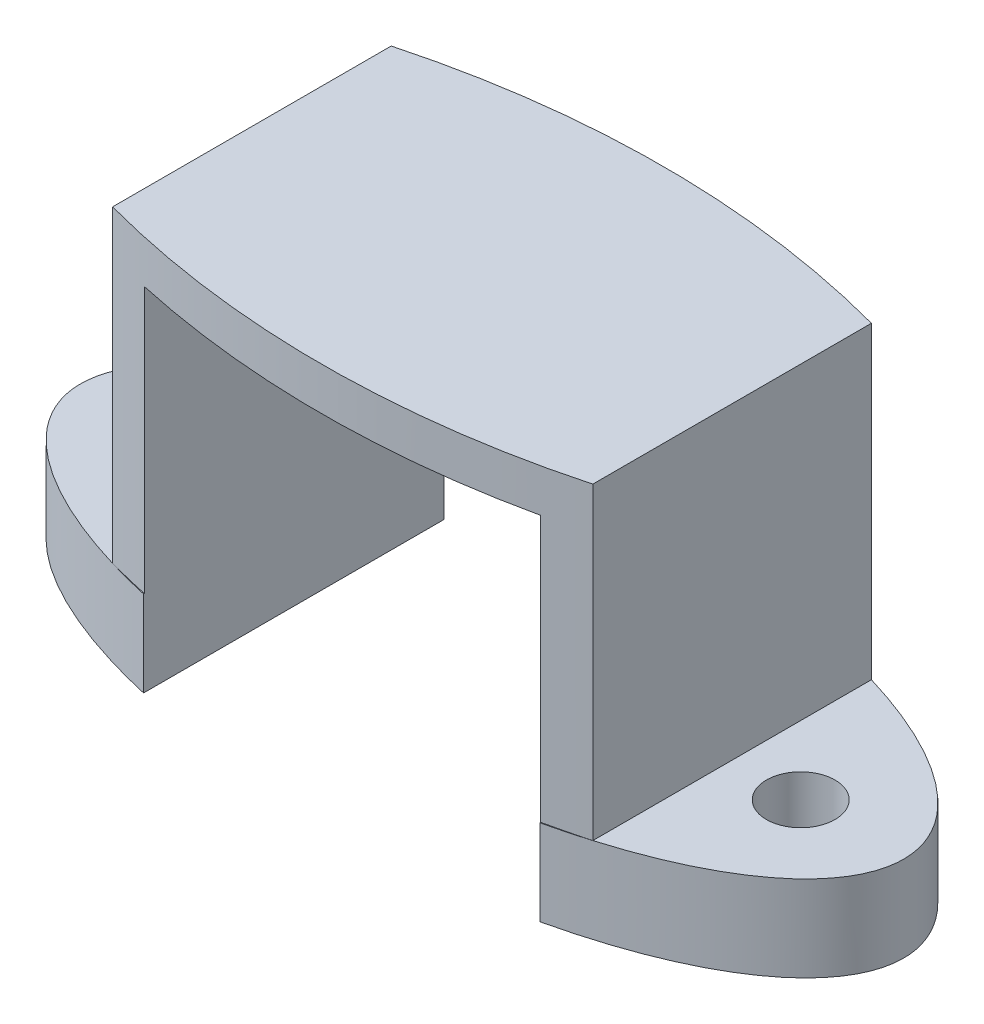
ISO-10303-21;
HEADER;
FILE_DESCRIPTION(('STEP AP214'),'2;1');
FILE_NAME('part.step','',(''),(''),'','','');
FILE_SCHEMA(('AUTOMOTIVE_DESIGN { 1 0 10303 214 1 1 1 1 }'));
ENDSEC;
DATA;
#1=APPLICATION_CONTEXT('core data for automotive mechanical design processes');
#2=APPLICATION_PROTOCOL_DEFINITION('international standard','automotive_design',2000,#1);
#3=PRODUCT_CONTEXT('',#1,'mechanical');
#4=PRODUCT('Part','Part','',(#3));
#5=PRODUCT_RELATED_PRODUCT_CATEGORY('part','',(#4));
#6=PRODUCT_DEFINITION_FORMATION('','',#4);
#7=PRODUCT_DEFINITION_CONTEXT('part definition',#1,'design');
#8=PRODUCT_DEFINITION('design','',#6,#7);
#9=PRODUCT_DEFINITION_SHAPE('','',#8);
#10=(LENGTH_UNIT() NAMED_UNIT(*) SI_UNIT(.MILLI.,.METRE.));
#11=(NAMED_UNIT(*) PLANE_ANGLE_UNIT() SI_UNIT($,.RADIAN.));
#12=(NAMED_UNIT(*) SI_UNIT($,.STERADIAN.) SOLID_ANGLE_UNIT());
#13=UNCERTAINTY_MEASURE_WITH_UNIT(LENGTH_MEASURE(1.E-05),#10,'distance_accuracy_value','');
#14=(GEOMETRIC_REPRESENTATION_CONTEXT(3) GLOBAL_UNCERTAINTY_ASSIGNED_CONTEXT((#13)) GLOBAL_UNIT_ASSIGNED_CONTEXT((#10,
#11,#12)) REPRESENTATION_CONTEXT('',''));
#15=CARTESIAN_POINT('',(0.,0.,0.));
#16=DIRECTION('',(0.,0.,1.));
#17=DIRECTION('',(1.,0.,0.));
#18=AXIS2_PLACEMENT_3D('',#15,#16,#17);
#19=CARTESIAN_POINT('',(0.,2.5,0.));
#20=DIRECTION('',(0.,1.,0.));
#21=DIRECTION('',(0.,0.,1.));
#22=AXIS2_PLACEMENT_3D('',#19,#20,#21);
#23=PLANE('',#22);
#24=DIRECTION('',(0.,0.,-1.));
#25=VECTOR('',#24,1.);
#26=CARTESIAN_POINT('',(5.775,2.5,0.));
#27=LINE('',#26,#25);
#28=CARTESIAN_POINT('',(5.775,2.5,-4.36066307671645));
#29=VERTEX_POINT('',#28);
#30=CARTESIAN_POINT('',(5.775,2.5,-4.3829169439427));
#31=VERTEX_POINT('',#30);
#32=EDGE_CURVE('E158',#29,#31,#27,.T.);
#33=ORIENTED_EDGE('',*,*,#32,.F.);
#34=CARTESIAN_POINT('',(0.,2.5,21.9150286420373));
#35=DIRECTION('',(0.,1.,0.));
#36=DIRECTION('',(0.,0.,-1.));
#37=AXIS2_PLACEMENT_3D('',#34,#35,#36);
#38=CIRCLE('',#37,26.9028362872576);
#39=CARTESIAN_POINT('',(6.99999999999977,2.5,-4.06116431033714));
#40=VERTEX_POINT('',#39);
#41=EDGE_CURVE('E155',#40,#29,#38,.T.);
#42=ORIENTED_EDGE('',*,*,#41,.F.);
#43=CARTESIAN_POINT('',(0.,2.5,0.));
#44=DIRECTION('',(0.,1.,0.));
#45=DIRECTION('',(1.,0.,0.));
#46=AXIS2_PLACEMENT_3D('',#43,#44,#45);
#47=ELLIPSE('',#46,12.,5.);
#48=EDGE_CURVE('E205',#40,#31,#47,.T.);
#49=ORIENTED_EDGE('',*,*,#48,.T.);
#50=EDGE_LOOP('',(#33,#42,#49));
#51=FACE_BOUND('',#50,.T.);
#52=ADVANCED_FACE('F39',(#51),#23,.T.);
#53=DIRECTION('',(0.,0.,-1.));
#54=VECTOR('',#53,1.);
#55=CARTESIAN_POINT('',(5.775,2.5,0.));
#56=LINE('',#55,#54);
#57=CARTESIAN_POINT('',(5.775,2.5,4.3829169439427));
#58=VERTEX_POINT('',#57);
#59=CARTESIAN_POINT('',(5.775,2.5,4.36066097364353));
#60=VERTEX_POINT('',#59);
#61=EDGE_CURVE('E237',#58,#60,#56,.T.);
#62=ORIENTED_EDGE('',*,*,#61,.F.);
#63=CARTESIAN_POINT('',(6.99999999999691,2.5,4.06116431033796));
#64=VERTEX_POINT('',#63);
#65=EDGE_CURVE('E63',#58,#64,#47,.T.);
#66=ORIENTED_EDGE('',*,*,#65,.T.);
#67=CARTESIAN_POINT('',(0.,2.5,-21.9152131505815));
#68=DIRECTION('',(0.,1.,0.));
#69=DIRECTION('',(0.,0.,1.));
#70=AXIS2_PLACEMENT_3D('',#67,#68,#69);
#71=CIRCLE('',#70,26.9030144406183);
#72=EDGE_CURVE('E176',#60,#64,#71,.T.);
#73=ORIENTED_EDGE('',*,*,#72,.F.);
#74=EDGE_LOOP('',(#62,#66,#73));
#75=FACE_BOUND('',#74,.T.);
#76=ADVANCED_FACE('F282',(#75),#23,.T.);
#77=DIRECTION('',(0.,-1.,0.));
#78=VECTOR('',#77,1.);
#79=SURFACE_OF_LINEAR_EXTRUSION('',#47,#78);
#80=CARTESIAN_POINT('',(0.,0.,0.));
#81=DIRECTION('',(0.,1.,0.));
#82=DIRECTION('',(1.,0.,0.));
#83=AXIS2_PLACEMENT_3D('',#80,#81,#82);
#84=ELLIPSE('',#83,12.,5.);
#85=CARTESIAN_POINT('',(5.775,0.,4.3829169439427));
#86=VERTEX_POINT('',#85);
#87=CARTESIAN_POINT('',(5.775,0.,-4.3829169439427));
#88=VERTEX_POINT('',#87);
#89=EDGE_CURVE('E197',#86,#88,#84,.T.);
#90=ORIENTED_EDGE('',*,*,#89,.T.);
#91=DIRECTION('',(0.,-1.,0.));
#92=VECTOR('',#91,1.);
#93=CARTESIAN_POINT('',(5.775,2.5,-4.3829169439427));
#94=LINE('',#93,#92);
#95=EDGE_CURVE('E153',#88,#31,#94,.F.);
#96=ORIENTED_EDGE('',*,*,#95,.T.);
#97=ORIENTED_EDGE('',*,*,#48,.F.);
#98=EDGE_CURVE('E255',#64,#40,#47,.T.);
#99=ORIENTED_EDGE('',*,*,#98,.F.);
#100=ORIENTED_EDGE('',*,*,#65,.F.);
#101=DIRECTION('',(0.,-1.,0.));
#102=VECTOR('',#101,1.);
#103=CARTESIAN_POINT('',(5.775,2.5,4.3829169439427));
#104=LINE('',#103,#102);
#105=EDGE_CURVE('E239',#58,#86,#104,.T.);
#106=ORIENTED_EDGE('',*,*,#105,.T.);
#107=EDGE_LOOP('',(#90,#96,#97,#99,#100,#106));
#108=FACE_BOUND('',#107,.T.);
#109=ADVANCED_FACE('F249',(#108),#79,.F.);
#110=CARTESIAN_POINT('',(0.,0.,0.));
#111=DIRECTION('',(0.,1.,0.));
#112=DIRECTION('',(0.,0.,1.));
#113=AXIS2_PLACEMENT_3D('',#110,#111,#112);
#114=PLANE('',#113);
#115=CARTESIAN_POINT('',(9.,0.,0.));
#116=DIRECTION('',(0.,1.,0.));
#117=DIRECTION('',(0.,0.,1.));
#118=AXIS2_PLACEMENT_3D('',#115,#116,#117);
#119=CIRCLE('',#118,1.);
#120=CARTESIAN_POINT('',(9.,0.,1.));
#121=VERTEX_POINT('',#120);
#122=EDGE_CURVE('E194',#121,#121,#119,.T.);
#123=ORIENTED_EDGE('',*,*,#122,.T.);
#124=EDGE_LOOP('',(#123));
#125=FACE_BOUND('',#124,.T.);
#126=ORIENTED_EDGE('',*,*,#89,.F.);
#127=DIRECTION('',(0.,0.,1.));
#128=VECTOR('',#127,1.);
#129=CARTESIAN_POINT('',(5.775,0.,-10.));
#130=LINE('',#129,#128);
#131=EDGE_CURVE('E229',#88,#86,#130,.T.);
#132=ORIENTED_EDGE('',*,*,#131,.F.);
#133=EDGE_LOOP('',(#126,#132));
#134=FACE_BOUND('',#133,.T.);
#135=ADVANCED_FACE('F273',(#125,#134),#114,.F.);
#136=DIRECTION('',(0.,0.,1.));
#137=VECTOR('',#136,1.);
#138=CARTESIAN_POINT('',(-5.775,2.5,0.));
#139=LINE('',#138,#137);
#140=CARTESIAN_POINT('',(-5.775,2.5,-4.3829169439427));
#141=VERTEX_POINT('',#140);
#142=CARTESIAN_POINT('',(-5.775,2.5,-4.36066307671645));
#143=VERTEX_POINT('',#142);
#144=EDGE_CURVE('E132',#141,#143,#139,.T.);
#145=ORIENTED_EDGE('',*,*,#144,.F.);
#146=CARTESIAN_POINT('',(-6.99999999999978,2.5,-4.06116431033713));
#147=VERTEX_POINT('',#146);
#148=EDGE_CURVE('E210',#141,#147,#47,.T.);
#149=ORIENTED_EDGE('',*,*,#148,.T.);
#150=EDGE_CURVE('E152',#143,#147,#38,.T.);
#151=ORIENTED_EDGE('',*,*,#150,.F.);
#152=EDGE_LOOP('',(#145,#149,#151));
#153=FACE_BOUND('',#152,.T.);
#154=ADVANCED_FACE('F275',(#153),#23,.T.);
#155=DIRECTION('',(0.,0.,-1.));
#156=VECTOR('',#155,1.);
#157=CARTESIAN_POINT('',(6.99999999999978,2.5,4.06116431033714));
#158=LINE('',#157,#156);
#159=EDGE_CURVE('E166',#64,#40,#158,.T.);
#160=ORIENTED_EDGE('',*,*,#159,.F.);
#161=ORIENTED_EDGE('',*,*,#98,.T.);
#162=EDGE_LOOP('',(#160,#161));
#163=FACE_BOUND('',#162,.T.);
#164=CARTESIAN_POINT('',(9.,2.5,0.));
#165=DIRECTION('',(0.,1.,0.));
#166=DIRECTION('',(0.,0.,1.));
#167=AXIS2_PLACEMENT_3D('',#164,#165,#166);
#168=CIRCLE('',#167,1.);
#169=CARTESIAN_POINT('',(9.,2.5,1.));
#170=VERTEX_POINT('',#169);
#171=EDGE_CURVE('E198',#170,#170,#168,.T.);
#172=ORIENTED_EDGE('',*,*,#171,.F.);
#173=EDGE_LOOP('',(#172));
#174=FACE_BOUND('',#173,.T.);
#175=ADVANCED_FACE('F256',(#163,#174),#23,.T.);
#176=DIRECTION('',(0.,0.,1.));
#177=VECTOR('',#176,1.);
#178=CARTESIAN_POINT('',(-5.775,2.5,0.));
#179=LINE('',#178,#177);
#180=CARTESIAN_POINT('',(-5.775,2.5,4.36066097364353));
#181=VERTEX_POINT('',#180);
#182=CARTESIAN_POINT('',(-5.775,2.5,4.3829169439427));
#183=VERTEX_POINT('',#182);
#184=EDGE_CURVE('E219',#181,#183,#179,.T.);
#185=ORIENTED_EDGE('',*,*,#184,.F.);
#186=CARTESIAN_POINT('',(-6.99999999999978,2.5,4.06116431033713));
#187=VERTEX_POINT('',#186);
#188=EDGE_CURVE('E177',#187,#181,#71,.T.);
#189=ORIENTED_EDGE('',*,*,#188,.F.);
#190=EDGE_CURVE('E225',#187,#183,#47,.T.);
#191=ORIENTED_EDGE('',*,*,#190,.T.);
#192=EDGE_LOOP('',(#185,#189,#191));
#193=FACE_BOUND('',#192,.T.);
#194=ADVANCED_FACE('F223',(#193),#23,.T.);
#195=CARTESIAN_POINT('',(-5.775,0.,-4.3829169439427));
#196=VERTEX_POINT('',#195);
#197=CARTESIAN_POINT('',(-5.775,0.,4.3829169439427));
#198=VERTEX_POINT('',#197);
#199=EDGE_CURVE('E214',#196,#198,#84,.T.);
#200=ORIENTED_EDGE('',*,*,#199,.T.);
#201=DIRECTION('',(0.,-1.,0.));
#202=VECTOR('',#201,1.);
#203=CARTESIAN_POINT('',(-5.775,2.5,4.3829169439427));
#204=LINE('',#203,#202);
#205=EDGE_CURVE('E137',#198,#183,#204,.F.);
#206=ORIENTED_EDGE('',*,*,#205,.T.);
#207=ORIENTED_EDGE('',*,*,#190,.F.);
#208=EDGE_CURVE('E211',#147,#187,#47,.T.);
#209=ORIENTED_EDGE('',*,*,#208,.F.);
#210=ORIENTED_EDGE('',*,*,#148,.F.);
#211=DIRECTION('',(0.,-1.,0.));
#212=VECTOR('',#211,1.);
#213=CARTESIAN_POINT('',(-5.775,2.5,-4.3829169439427));
#214=LINE('',#213,#212);
#215=EDGE_CURVE('E234',#141,#196,#214,.T.);
#216=ORIENTED_EDGE('',*,*,#215,.T.);
#217=EDGE_LOOP('',(#200,#206,#207,#209,#210,#216));
#218=FACE_BOUND('',#217,.T.);
#219=ADVANCED_FACE('F41',(#218),#79,.F.);
#220=DIRECTION('',(0.,0.,1.));
#221=VECTOR('',#220,1.);
#222=CARTESIAN_POINT('',(-6.99999999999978,2.5,4.06116431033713));
#223=LINE('',#222,#221);
#224=EDGE_CURVE('E173',#147,#187,#223,.T.);
#225=ORIENTED_EDGE('',*,*,#224,.F.);
#226=ORIENTED_EDGE('',*,*,#208,.T.);
#227=EDGE_LOOP('',(#225,#226));
#228=FACE_BOUND('',#227,.T.);
#229=CARTESIAN_POINT('',(-9.,2.5,0.));
#230=DIRECTION('',(0.,1.,0.));
#231=DIRECTION('',(0.,0.,1.));
#232=AXIS2_PLACEMENT_3D('',#229,#230,#231);
#233=CIRCLE('',#232,1.);
#234=CARTESIAN_POINT('',(-9.,2.5,1.));
#235=VERTEX_POINT('',#234);
#236=EDGE_CURVE('E201',#235,#235,#233,.T.);
#237=ORIENTED_EDGE('',*,*,#236,.F.);
#238=EDGE_LOOP('',(#237));
#239=FACE_BOUND('',#238,.T.);
#240=ADVANCED_FACE('F264',(#228,#239),#23,.T.);
#241=CARTESIAN_POINT('',(-9.,0.,0.));
#242=DIRECTION('',(0.,1.,0.));
#243=DIRECTION('',(0.,0.,1.));
#244=AXIS2_PLACEMENT_3D('',#241,#242,#243);
#245=CIRCLE('',#244,1.);
#246=CARTESIAN_POINT('',(-9.,0.,1.));
#247=VERTEX_POINT('',#246);
#248=EDGE_CURVE('E193',#247,#247,#245,.T.);
#249=ORIENTED_EDGE('',*,*,#248,.T.);
#250=EDGE_LOOP('',(#249));
#251=FACE_BOUND('',#250,.T.);
#252=ORIENTED_EDGE('',*,*,#199,.F.);
#253=DIRECTION('',(0.,0.,1.));
#254=VECTOR('',#253,1.);
#255=CARTESIAN_POINT('',(-5.775,0.,-10.));
#256=LINE('',#255,#254);
#257=EDGE_CURVE('E146',#196,#198,#256,.T.);
#258=ORIENTED_EDGE('',*,*,#257,.T.);
#259=EDGE_LOOP('',(#252,#258));
#260=FACE_BOUND('',#259,.T.);
#261=ADVANCED_FACE('F270',(#251,#260),#114,.F.);
#262=CARTESIAN_POINT('',(-9.,0.,0.));
#263=DIRECTION('',(0.,1.,0.));
#264=DIRECTION('',(0.,0.,1.));
#265=AXIS2_PLACEMENT_3D('',#262,#263,#264);
#266=CYLINDRICAL_SURFACE('',#265,1.);
#267=ORIENTED_EDGE('',*,*,#248,.F.);
#268=EDGE_LOOP('',(#267));
#269=FACE_BOUND('',#268,.T.);
#270=ORIENTED_EDGE('',*,*,#236,.T.);
#271=EDGE_LOOP('',(#270));
#272=FACE_BOUND('',#271,.T.);
#273=ADVANCED_FACE('F284',(#269,#272),#266,.F.);
#274=CARTESIAN_POINT('',(9.,0.,0.));
#275=DIRECTION('',(0.,1.,0.));
#276=DIRECTION('',(0.,0.,1.));
#277=AXIS2_PLACEMENT_3D('',#274,#275,#276);
#278=CYLINDRICAL_SURFACE('',#277,1.);
#279=ORIENTED_EDGE('',*,*,#122,.F.);
#280=EDGE_LOOP('',(#279));
#281=FACE_BOUND('',#280,.T.);
#282=ORIENTED_EDGE('',*,*,#171,.T.);
#283=EDGE_LOOP('',(#282));
#284=FACE_BOUND('',#283,.T.);
#285=ADVANCED_FACE('F309',(#281,#284),#278,.F.);
#286=CARTESIAN_POINT('',(0.,11.5,21.9150286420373));
#287=DIRECTION('',(0.,-1.,0.));
#288=DIRECTION('',(0.,0.,-1.));
#289=AXIS2_PLACEMENT_3D('',#286,#287,#288);
#290=CYLINDRICAL_SURFACE('',#289,26.9028362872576);
#291=ORIENTED_EDGE('',*,*,#41,.T.);
#292=DIRECTION('',(0.,-1.,0.));
#293=VECTOR('',#292,1.);
#294=CARTESIAN_POINT('',(5.775,11.5,-4.36066307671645));
#295=LINE('',#294,#293);
#296=CARTESIAN_POINT('',(5.775,10.25,-4.36066307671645));
#297=VERTEX_POINT('',#296);
#298=EDGE_CURVE('E151',#29,#297,#295,.F.);
#299=ORIENTED_EDGE('',*,*,#298,.T.);
#300=CARTESIAN_POINT('',(0.,10.25,21.9150286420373));
#301=DIRECTION('',(0.,1.,0.));
#302=DIRECTION('',(-1.,0.,0.));
#303=AXIS2_PLACEMENT_3D('',#300,#301,#302);
#304=CIRCLE('',#303,26.9028362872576);
#305=CARTESIAN_POINT('',(-5.775,10.25,-4.36066307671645));
#306=VERTEX_POINT('',#305);
#307=EDGE_CURVE('E142',#297,#306,#304,.T.);
#308=ORIENTED_EDGE('',*,*,#307,.T.);
#309=DIRECTION('',(0.,-1.,0.));
#310=VECTOR('',#309,1.);
#311=CARTESIAN_POINT('',(-5.775,11.5,-4.36066307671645));
#312=LINE('',#311,#310);
#313=EDGE_CURVE('E129',#306,#143,#312,.T.);
#314=ORIENTED_EDGE('',*,*,#313,.T.);
#315=ORIENTED_EDGE('',*,*,#150,.T.);
#316=DIRECTION('',(0.,-1.,0.));
#317=VECTOR('',#316,1.);
#318=CARTESIAN_POINT('',(-6.99999999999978,11.5,-4.06116431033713));
#319=LINE('',#318,#317);
#320=CARTESIAN_POINT('',(-6.99999999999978,11.5,-4.06116431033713));
#321=VERTEX_POINT('',#320);
#322=EDGE_CURVE('E190',#321,#147,#319,.T.);
#323=ORIENTED_EDGE('',*,*,#322,.F.);
#324=CARTESIAN_POINT('',(0.,11.5,21.9150286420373));
#325=DIRECTION('',(0.,1.,0.));
#326=DIRECTION('',(0.,0.,-1.));
#327=AXIS2_PLACEMENT_3D('',#324,#325,#326);
#328=CIRCLE('',#327,26.9028362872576);
#329=CARTESIAN_POINT('',(6.99999999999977,11.5,-4.06116431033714));
#330=VERTEX_POINT('',#329);
#331=EDGE_CURVE('E162',#330,#321,#328,.T.);
#332=ORIENTED_EDGE('',*,*,#331,.F.);
#333=DIRECTION('',(0.,-1.,0.));
#334=VECTOR('',#333,1.);
#335=CARTESIAN_POINT('',(6.99999999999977,11.5,-4.06116431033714));
#336=LINE('',#335,#334);
#337=EDGE_CURVE('E171',#330,#40,#336,.T.);
#338=ORIENTED_EDGE('',*,*,#337,.T.);
#339=EDGE_LOOP('',(#291,#299,#308,#314,#315,#323,#332,#338));
#340=FACE_BOUND('',#339,.T.);
#341=ADVANCED_FACE('F150',(#340),#290,.T.);
#342=CARTESIAN_POINT('',(-6.99999999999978,11.5,4.06116431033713));
#343=DIRECTION('',(1.,0.,0.));
#344=DIRECTION('',(0.,0.,-1.));
#345=AXIS2_PLACEMENT_3D('',#342,#343,#344);
#346=PLANE('',#345);
#347=ORIENTED_EDGE('',*,*,#224,.T.);
#348=DIRECTION('',(0.,-1.,0.));
#349=VECTOR('',#348,1.);
#350=CARTESIAN_POINT('',(-6.99999999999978,11.5,4.06116431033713));
#351=LINE('',#350,#349);
#352=CARTESIAN_POINT('',(-6.99999999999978,11.5,4.06116431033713));
#353=VERTEX_POINT('',#352);
#354=EDGE_CURVE('E187',#353,#187,#351,.T.);
#355=ORIENTED_EDGE('',*,*,#354,.F.);
#356=DIRECTION('',(0.,0.,1.));
#357=VECTOR('',#356,1.);
#358=CARTESIAN_POINT('',(-6.99999999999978,11.5,4.06116431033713));
#359=LINE('',#358,#357);
#360=EDGE_CURVE('E165',#321,#353,#359,.T.);
#361=ORIENTED_EDGE('',*,*,#360,.F.);
#362=ORIENTED_EDGE('',*,*,#322,.T.);
#363=EDGE_LOOP('',(#347,#355,#361,#362));
#364=FACE_BOUND('',#363,.T.);
#365=ADVANCED_FACE('F345',(#364),#346,.F.);
#366=CARTESIAN_POINT('',(0.,11.5,-21.9152131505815));
#367=DIRECTION('',(0.,-1.,0.));
#368=DIRECTION('',(0.,0.,-1.));
#369=AXIS2_PLACEMENT_3D('',#366,#367,#368);
#370=CYLINDRICAL_SURFACE('',#369,26.9030144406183);
#371=CARTESIAN_POINT('',(0.,10.25,-21.9152131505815));
#372=DIRECTION('',(0.,1.,0.));
#373=DIRECTION('',(-1.,0.,0.));
#374=AXIS2_PLACEMENT_3D('',#371,#372,#373);
#375=CIRCLE('',#374,26.9030144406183);
#376=CARTESIAN_POINT('',(-5.775,10.25,4.36066097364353));
#377=VERTEX_POINT('',#376);
#378=CARTESIAN_POINT('',(5.775,10.25,4.36066097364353));
#379=VERTEX_POINT('',#378);
#380=EDGE_CURVE('E48',#377,#379,#375,.T.);
#381=ORIENTED_EDGE('',*,*,#380,.T.);
#382=DIRECTION('',(0.,-1.,0.));
#383=VECTOR('',#382,1.);
#384=CARTESIAN_POINT('',(5.775,11.5,4.36066097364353));
#385=LINE('',#384,#383);
#386=EDGE_CURVE('E11',#379,#60,#385,.T.);
#387=ORIENTED_EDGE('',*,*,#386,.T.);
#388=ORIENTED_EDGE('',*,*,#72,.T.);
#389=DIRECTION('',(0.,-1.,0.));
#390=VECTOR('',#389,1.);
#391=CARTESIAN_POINT('',(6.99999999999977,11.5,4.06116431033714));
#392=LINE('',#391,#390);
#393=CARTESIAN_POINT('',(6.99999999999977,11.5,4.06116431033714));
#394=VERTEX_POINT('',#393);
#395=EDGE_CURVE('E184',#394,#64,#392,.T.);
#396=ORIENTED_EDGE('',*,*,#395,.F.);
#397=CARTESIAN_POINT('',(0.,11.5,-21.9152131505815));
#398=DIRECTION('',(0.,1.,0.));
#399=DIRECTION('',(0.,0.,1.));
#400=AXIS2_PLACEMENT_3D('',#397,#398,#399);
#401=CIRCLE('',#400,26.9030144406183);
#402=EDGE_CURVE('E168',#353,#394,#401,.T.);
#403=ORIENTED_EDGE('',*,*,#402,.F.);
#404=ORIENTED_EDGE('',*,*,#354,.T.);
#405=ORIENTED_EDGE('',*,*,#188,.T.);
#406=DIRECTION('',(0.,-1.,0.));
#407=VECTOR('',#406,1.);
#408=CARTESIAN_POINT('',(-5.775,11.5,4.36066097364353));
#409=LINE('',#408,#407);
#410=EDGE_CURVE('E209',#181,#377,#409,.F.);
#411=ORIENTED_EDGE('',*,*,#410,.T.);
#412=EDGE_LOOP('',(#381,#387,#388,#396,#403,#404,#405,#411));
#413=FACE_BOUND('',#412,.T.);
#414=ADVANCED_FACE('F216',(#413),#370,.T.);
#415=CARTESIAN_POINT('',(6.99999999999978,11.5,4.06116431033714));
#416=DIRECTION('',(-1.,0.,0.));
#417=DIRECTION('',(0.,0.,1.));
#418=AXIS2_PLACEMENT_3D('',#415,#416,#417);
#419=PLANE('',#418);
#420=ORIENTED_EDGE('',*,*,#159,.T.);
#421=ORIENTED_EDGE('',*,*,#337,.F.);
#422=DIRECTION('',(0.,0.,-1.));
#423=VECTOR('',#422,1.);
#424=CARTESIAN_POINT('',(6.99999999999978,11.5,4.06116431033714));
#425=LINE('',#424,#423);
#426=EDGE_CURVE('E170',#394,#330,#425,.T.);
#427=ORIENTED_EDGE('',*,*,#426,.F.);
#428=ORIENTED_EDGE('',*,*,#395,.T.);
#429=EDGE_LOOP('',(#420,#421,#427,#428));
#430=FACE_BOUND('',#429,.T.);
#431=ADVANCED_FACE('F354',(#430),#419,.F.);
#432=CARTESIAN_POINT('',(0.,11.5,21.9150286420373));
#433=DIRECTION('',(0.,-1.,0.));
#434=DIRECTION('',(0.,0.,-1.));
#435=AXIS2_PLACEMENT_3D('',#432,#433,#434);
#436=PLANE('',#435);
#437=ORIENTED_EDGE('',*,*,#331,.T.);
#438=ORIENTED_EDGE('',*,*,#360,.T.);
#439=ORIENTED_EDGE('',*,*,#402,.T.);
#440=ORIENTED_EDGE('',*,*,#426,.T.);
#441=EDGE_LOOP('',(#437,#438,#439,#440));
#442=FACE_BOUND('',#441,.T.);
#443=ADVANCED_FACE('F363',(#442),#436,.F.);
#444=CARTESIAN_POINT('',(5.775,10.25,-10.));
#445=DIRECTION('',(0.,1.,0.));
#446=DIRECTION('',(-1.,0.,0.));
#447=AXIS2_PLACEMENT_3D('',#444,#445,#446);
#448=PLANE('',#447);
#449=DIRECTION('',(0.,0.,1.));
#450=VECTOR('',#449,1.);
#451=CARTESIAN_POINT('',(5.775,10.25,-10.));
#452=LINE('',#451,#450);
#453=EDGE_CURVE('E226',#297,#379,#452,.T.);
#454=ORIENTED_EDGE('',*,*,#453,.T.);
#455=ORIENTED_EDGE('',*,*,#380,.F.);
#456=DIRECTION('',(0.,0.,1.));
#457=VECTOR('',#456,1.);
#458=CARTESIAN_POINT('',(-5.775,10.25,-10.));
#459=LINE('',#458,#457);
#460=EDGE_CURVE('E55',#306,#377,#459,.T.);
#461=ORIENTED_EDGE('',*,*,#460,.F.);
#462=ORIENTED_EDGE('',*,*,#307,.F.);
#463=EDGE_LOOP('',(#454,#455,#461,#462));
#464=FACE_BOUND('',#463,.T.);
#465=ADVANCED_FACE('F141',(#464),#448,.F.);
#466=CARTESIAN_POINT('',(5.775,0.,-10.));
#467=DIRECTION('',(1.,0.,0.));
#468=DIRECTION('',(0.,1.,0.));
#469=AXIS2_PLACEMENT_3D('',#466,#467,#468);
#470=PLANE('',#469);
#471=ORIENTED_EDGE('',*,*,#131,.T.);
#472=ORIENTED_EDGE('',*,*,#105,.F.);
#473=ORIENTED_EDGE('',*,*,#61,.T.);
#474=ORIENTED_EDGE('',*,*,#386,.F.);
#475=ORIENTED_EDGE('',*,*,#453,.F.);
#476=ORIENTED_EDGE('',*,*,#298,.F.);
#477=ORIENTED_EDGE('',*,*,#32,.T.);
#478=ORIENTED_EDGE('',*,*,#95,.F.);
#479=EDGE_LOOP('',(#471,#472,#473,#474,#475,#476,#477,#478));
#480=FACE_BOUND('',#479,.T.);
#481=ADVANCED_FACE('F244',(#480),#470,.F.);
#482=CARTESIAN_POINT('',(-5.775,10.25,-10.));
#483=DIRECTION('',(-1.,0.,0.));
#484=DIRECTION('',(0.,-1.,0.));
#485=AXIS2_PLACEMENT_3D('',#482,#483,#484);
#486=PLANE('',#485);
#487=ORIENTED_EDGE('',*,*,#144,.T.);
#488=ORIENTED_EDGE('',*,*,#313,.F.);
#489=ORIENTED_EDGE('',*,*,#460,.T.);
#490=ORIENTED_EDGE('',*,*,#410,.F.);
#491=ORIENTED_EDGE('',*,*,#184,.T.);
#492=ORIENTED_EDGE('',*,*,#205,.F.);
#493=ORIENTED_EDGE('',*,*,#257,.F.);
#494=ORIENTED_EDGE('',*,*,#215,.F.);
#495=EDGE_LOOP('',(#487,#488,#489,#490,#491,#492,#493,#494));
#496=FACE_BOUND('',#495,.T.);
#497=ADVANCED_FACE('F130',(#496),#486,.F.);
#498=CLOSED_SHELL('',(#52,#76,#109,#135,#154,#175,#194,#219,#240,#261,#273,#285,#341,#365,#414,
#431,#443,#465,#481,#497));
#499=MANIFOLD_SOLID_BREP('B2',#498);
#500=ADVANCED_BREP_SHAPE_REPRESENTATION('',(#18,#499),#14);
#501=SHAPE_DEFINITION_REPRESENTATION(#9,#500);
ENDSEC;
END-ISO-10303-21;
